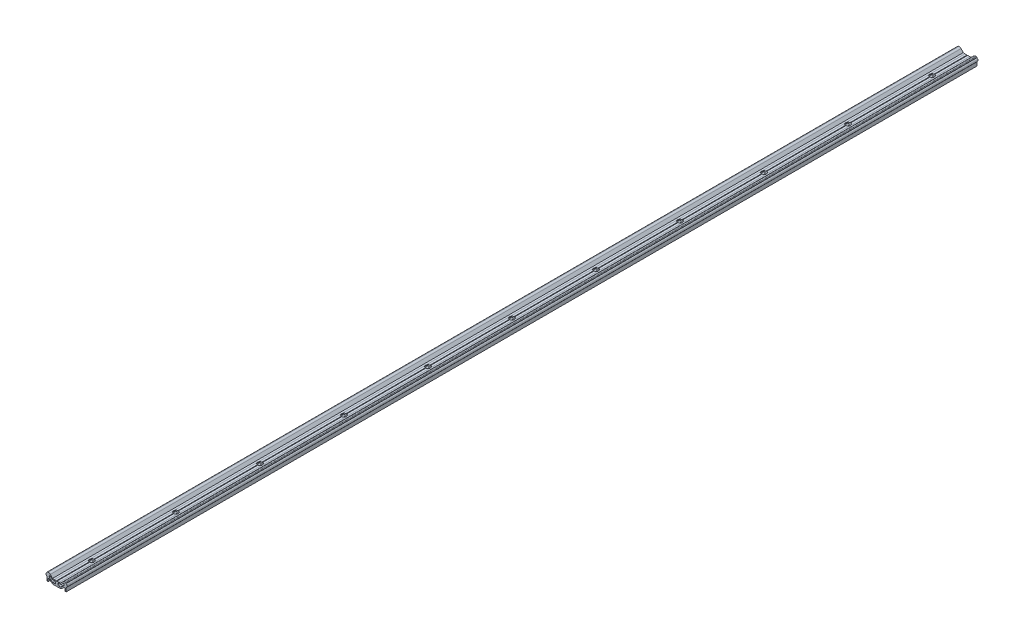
from build123d import *

# Parameters (mm, degrees)
EXTRUDE1_DEPTH                 = 813.0032
EXTRUDE1_DEPTH_BACK            = 813.0032
F_8_5_8_5_DIAMETER_HOLE1_D     = 8.5
F_8_5_8_5_DIAMETER_HOLE1_DEPTH = 38.1


with BuildPart() as part:
    # Sketch1 → Extrude1 (new, two sides: drawn at the far end of the back side and taken through both)
    with BuildSketch(Plane.XY.offset(-EXTRUDE1_DEPTH_BACK)):
        with BuildLine():
            Line((-13.292893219, 4.993398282), (-11.780369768, 3.480874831))
            ThreePointArc((-11.780369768, 3.480874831), (-11.224797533, 3.088235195), (-10.717244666, 2.635226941))
            Line((-10.717244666, 2.635226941), (-6.5, 0))
            Line((-6.5, 0), (6.5, 0))
            Line((6.5, 0), (10.717244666, 2.635226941))
            ThreePointArc((10.717244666, 2.635226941), (11.224797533, 3.088235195), (11.780369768, 3.480874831))
            Line((11.780369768, 3.480874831), (13.292893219, 4.993398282))
            ThreePointArc((13.292893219, 4.993398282), (14.382683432, 5.210171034), (15, 4.286291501))
            Line((15, 4.286291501), (15, 0))
            Line((15, 0), (17, 0))
            Line((17, 0), (17, 6.801613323))
            ThreePointArc((17, 6.801613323), (16.922474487, 6.959727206), (16.75, 6.99526249))
            ThreePointArc((16.75, 6.99526249), (19, 9.9), (16.75, 12.80473751))
            ThreePointArc((16.75, 12.80473751), (16.922474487, 12.840272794), (17, 12.998386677))
            Line((17, 12.998386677), (17, 13.4))
            ThreePointArc((17, 13.4), (16.707106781, 14.107106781), (16, 14.4))
            Line((16, 14.4), (14.871067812, 14.4))
            ThreePointArc((14.871067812, 14.4), (12.95765065, 14.019397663), (11.335533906, 12.935533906))
            Line((11.335533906, 12.935533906), (7.216982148, 8.816982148))
            Line((7.216982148, 8.816982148), (4.25, 8.4))
            Line((4.25, 8.4), (0.5, 8.4))
            Line((0.5, 8.4), (0, 7.9))
            Line((0, 7.9), (-0.5, 8.4))
            Line((-0.5, 8.4), (-4.25, 8.4))
            Line((-4.25, 8.4), (-7.216982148, 8.816982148))
            Line((-7.216982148, 8.816982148), (-11.335533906, 12.935533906))
            ThreePointArc((-11.335533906, 12.935533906), (-12.95765065, 14.019397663), (-14.871067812, 14.4))
            Line((-14.871067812, 14.4), (-16, 14.4))
            ThreePointArc((-16, 14.4), (-16.707106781, 14.107106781), (-17, 13.4))
            Line((-17, 13.4), (-17, 12.998386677))
            ThreePointArc((-17, 12.998386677), (-16.922474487, 12.840272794), (-16.75, 12.80473751))
            ThreePointArc((-16.75, 12.80473751), (-19, 9.9), (-16.75, 6.99526249))
            ThreePointArc((-16.75, 6.99526249), (-16.922474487, 6.959727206), (-17, 6.801613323))
            Line((-17, 6.801613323), (-17, 0))
            Line((-17, 0), (-15, 0))
            Line((-15, 0), (-15, 4.286291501))
            ThreePointArc((-15, 4.286291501), (-14.382683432, 5.210171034), (-13.292893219, 4.993398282))
        make_face()
        with BuildLine():
            Line((-10.366156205, 4.895088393), (-13.429418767, 7.958350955))
            ThreePointArc((-13.429418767, 7.958350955), (-13.578493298, 8.016783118), (-13.722662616, 7.947121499))
            ThreePointArc((-13.722662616, 7.947121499), (-13.008296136, 9.67704711), (-13.458354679, 11.49375))
            ThreePointArc((-13.458354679, 11.49375), (-13.385736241, 11.425), (-13.288911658, 11.4))
            Line((-13.288911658, 11.4), (-13.042640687, 11.4))
            ThreePointArc((-13.042640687, 11.4), (-12.659957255, 11.323879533), (-12.335533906, 11.107106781))
            Line((-12.335533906, 11.107106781), (-9.3, 8.071572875))
            ThreePointArc((-9.3, 8.071572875), (-8.002306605, 7.20448187), (-6.471572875, 6.9))
            Line((-6.471572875, 6.9), (-3.5, 6.9))
            ThreePointArc((-3.5, 6.9), (-2.439339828, 6.460660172), (-2, 5.4))
            Line((-2, 5.4), (-2, 4))
            ThreePointArc((-2, 4), (-2.439339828, 2.939339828), (-3.5, 2.5))
            Line((-3.5, 2.5), (-6.296558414, 2.5))
            ThreePointArc((-6.296558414, 2.5), (-6.710014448, 2.558107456), (-7.091437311, 2.727927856))
            Line((-7.091437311, 2.727927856), (-9.657406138, 4.331323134))
            ThreePointArc((-9.657406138, 4.331323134), (-10.027787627, 4.593082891), (-10.366156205, 4.895088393))
        make_face(mode=Mode.SUBTRACT)
        with BuildLine():
            Line((6.296558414, 2.5), (3.5, 2.5))
            ThreePointArc((3.5, 2.5), (2.439339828, 2.939339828), (2, 4))
            Line((2, 4), (2, 5.4))
            ThreePointArc((2, 5.4), (2.439339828, 6.460660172), (3.5, 6.9))
            Line((3.5, 6.9), (6.471572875, 6.9))
            ThreePointArc((6.471572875, 6.9), (8.002306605, 7.20448187), (9.3, 8.071572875))
            Line((9.3, 8.071572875), (12.335533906, 11.107106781))
            ThreePointArc((12.335533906, 11.107106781), (12.659957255, 11.323879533), (13.042640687, 11.4))
            Line((13.042640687, 11.4), (13.288911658, 11.4))
            ThreePointArc((13.288911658, 11.4), (13.385736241, 11.425), (13.458354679, 11.49375))
            ThreePointArc((13.458354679, 11.49375), (13.008296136, 9.67704711), (13.722662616, 7.947121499))
            ThreePointArc((13.722662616, 7.947121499), (13.578493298, 8.016783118), (13.429418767, 7.958350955))
            Line((13.429418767, 7.958350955), (10.366156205, 4.895088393))
            ThreePointArc((10.366156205, 4.895088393), (10.027787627, 4.593082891), (9.657406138, 4.331323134))
            Line((9.657406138, 4.331323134), (7.091437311, 2.727927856))
            ThreePointArc((7.091437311, 2.727927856), (6.710014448, 2.558107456), (6.296558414, 2.5))
        make_face(mode=Mode.SUBTRACT)
    extrude(amount=EXTRUDE1_DEPTH + EXTRUDE1_DEPTH_BACK)

    # 8.5 _8.5_ Diameter Hole1
    with Locations(Plane(origin=(0, 8.4, 750), x_dir=(0, 0, 1), z_dir=(0, 1, 0))):
        with Locations((0, 0), (-150, 0), (-300, 0), (-450, 0), (-600, 0), (-750, 0), (-900, 0), (-1050, 0), (-1200, 0), (-1350, 0), (-1500, 0)):
            Hole(F_8_5_8_5_DIAMETER_HOLE1_D / 2, depth=F_8_5_8_5_DIAMETER_HOLE1_DEPTH)


solid = part.part
